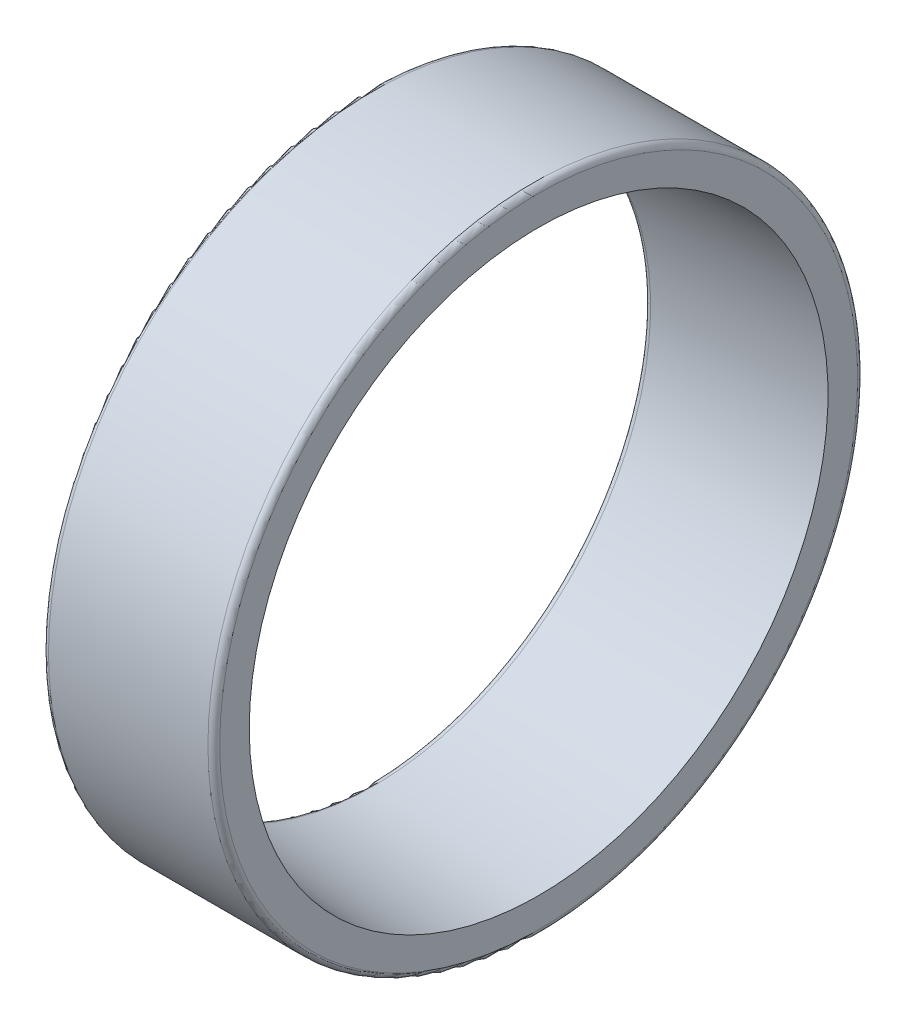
from build123d import *


with BuildPart() as part:
    # Esquisse1 → Base-R_volution (revolve)
    with BuildSketch(Plane(origin=(0, 0, 0), x_dir=(1, 0, 0), z_dir=(0, 1, 0)), mode=Mode.PRIVATE) as base_r_volution_sk:
        with BuildLine():
            Line((0, 47.876481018), (0, 54))
            ThreePointArc((0, 54), (0.292893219, 54.707106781), (1, 55))
            Line((1, 55), (28, 55))
            ThreePointArc((28, 55), (28.707106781, 54.707106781), (29, 54))
            Line((29, 54), (29, 49.002461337))
            Line((29, 49.002461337), (28.705963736, 48.980105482))
            Line((28.705963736, 48.980105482), (1.574373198, 46.917264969))
            Line((1.574373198, 46.917264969), (1.075812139, 46.8793589))
            ThreePointArc((1.075812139, 46.8793589), (0.320225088, 47.143060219), (0, 47.876481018))
        make_face()
    revolve(base_r_volution_sk.sketch.rotate(Axis((0, 0, 0), (1, 0, 0)), 180), axis=Axis((0, 0, 0), (1, 0, 0)))


solid = part.part
